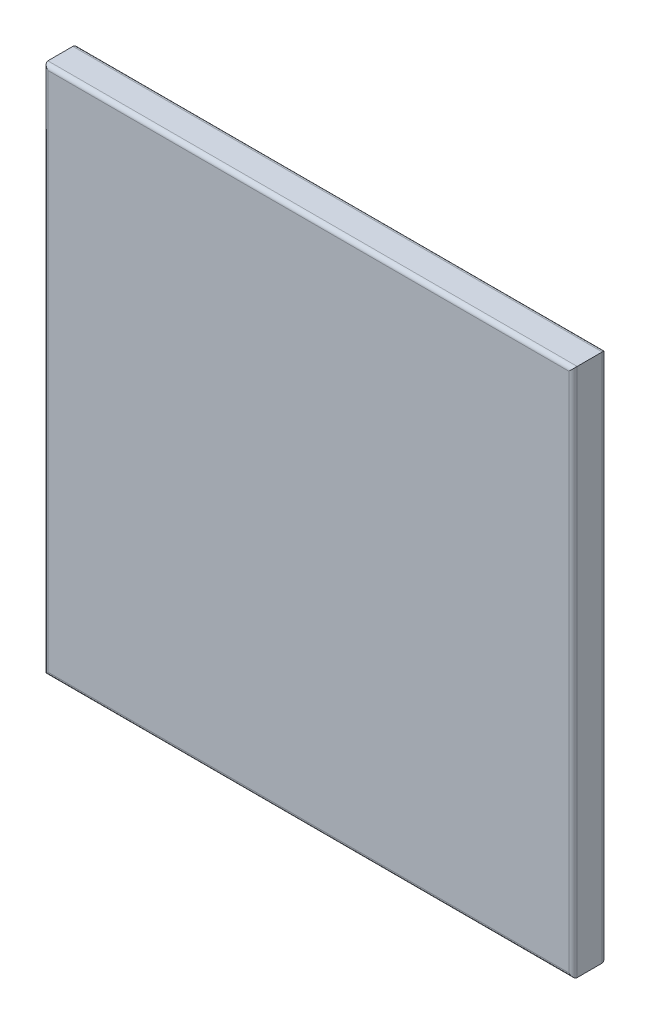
from build123d import *

# Parameters (mm, degrees)
SKIZZE1_W                       = 31.8
SKIZZE1_H                       = 31.8
AUFSATZ_LINEAR_AUSTRAGEN1_DEPTH = 2
VERRUNDUNG1_R                   = 0.25


with BuildPart() as part:
    # Skizze1 → Aufsatz-Linear austragen1 (new body)
    with BuildSketch(Plane.XY):
        Rectangle(SKIZZE1_W, SKIZZE1_H)
    extrude(amount=AUFSATZ_LINEAR_AUSTRAGEN1_DEPTH)

    # Verrundung1
    verrundung1_edges = [part.edges().sort_by_distance(p)[0] for p in [
        (-15.9, 0, 2),
        (0, -15.9, 2),
        (15.9, 0, 2),
        (0, -15.9, 0),
        (-15.9, 0, 0),
        (0, 15.9, 0),
        (15.9, 0, 0),
        (0, 15.9, 2),
    ]]
    fillet(verrundung1_edges, radius=VERRUNDUNG1_R)


solid = part.part
